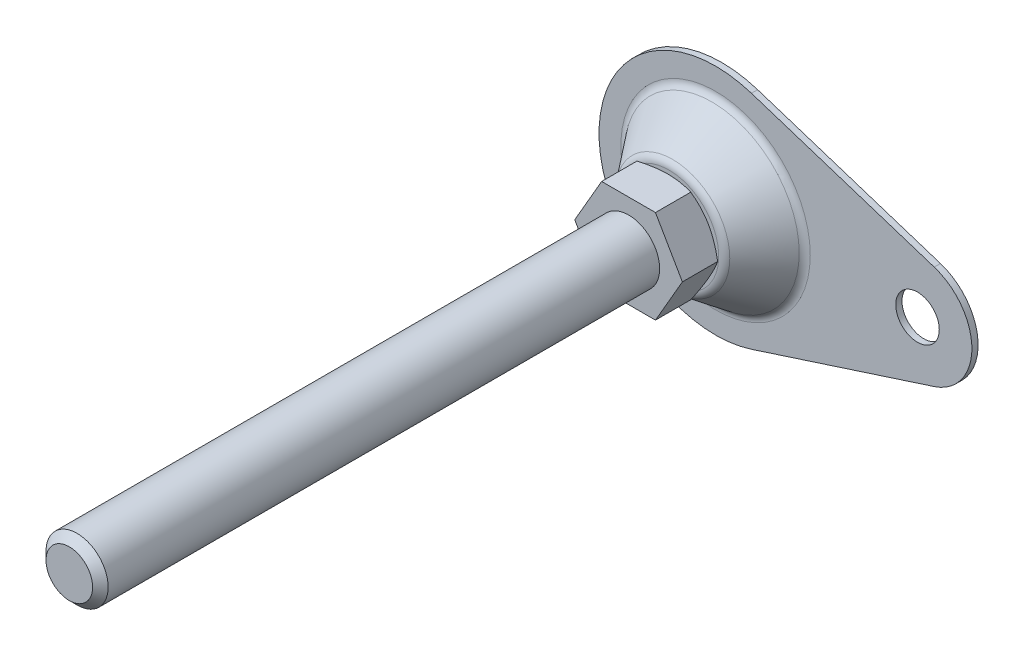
ISO-10303-21;
HEADER;
FILE_DESCRIPTION(('STEP AP214'),'2;1');
FILE_NAME('part.step','',(''),(''),'','','');
FILE_SCHEMA(('AUTOMOTIVE_DESIGN { 1 0 10303 214 1 1 1 1 }'));
ENDSEC;
DATA;
#1=APPLICATION_CONTEXT('core data for automotive mechanical design processes');
#2=APPLICATION_PROTOCOL_DEFINITION('international standard','automotive_design',2000,#1);
#3=PRODUCT_CONTEXT('',#1,'mechanical');
#4=PRODUCT('Part','Part','',(#3));
#5=PRODUCT_RELATED_PRODUCT_CATEGORY('part','',(#4));
#6=PRODUCT_DEFINITION_FORMATION('','',#4);
#7=PRODUCT_DEFINITION_CONTEXT('part definition',#1,'design');
#8=PRODUCT_DEFINITION('design','',#6,#7);
#9=PRODUCT_DEFINITION_SHAPE('','',#8);
#10=(LENGTH_UNIT() NAMED_UNIT(*) SI_UNIT(.MILLI.,.METRE.));
#11=(NAMED_UNIT(*) PLANE_ANGLE_UNIT() SI_UNIT($,.RADIAN.));
#12=(NAMED_UNIT(*) SI_UNIT($,.STERADIAN.) SOLID_ANGLE_UNIT());
#13=UNCERTAINTY_MEASURE_WITH_UNIT(LENGTH_MEASURE(1.E-05),#10,'distance_accuracy_value','');
#14=(GEOMETRIC_REPRESENTATION_CONTEXT(3) GLOBAL_UNCERTAINTY_ASSIGNED_CONTEXT((#13)) GLOBAL_UNIT_ASSIGNED_CONTEXT((#10,
#11,#12)) REPRESENTATION_CONTEXT('',''));
#15=CARTESIAN_POINT('',(0.,0.,0.));
#16=DIRECTION('',(0.,0.,1.));
#17=DIRECTION('',(1.,0.,0.));
#18=AXIS2_PLACEMENT_3D('',#15,#16,#17);
#19=CARTESIAN_POINT('',(65.,0.,2.));
#20=DIRECTION('',(0.,0.,1.));
#21=DIRECTION('',(1.,0.,0.));
#22=AXIS2_PLACEMENT_3D('',#19,#20,#21);
#23=PLANE('',#22);
#24=CARTESIAN_POINT('',(0.,0.,2.));
#25=DIRECTION('',(0.,0.,1.));
#26=DIRECTION('',(1.,0.,0.));
#27=AXIS2_PLACEMENT_3D('',#24,#25,#26);
#28=CIRCLE('',#27,30.4802116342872);
#29=CARTESIAN_POINT('',(30.4802116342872,0.,2.));
#30=VERTEX_POINT('',#29);
#31=EDGE_CURVE('E245',#30,#30,#28,.F.);
#32=ORIENTED_EDGE('',*,*,#31,.T.);
#33=EDGE_LOOP('',(#32));
#34=FACE_BOUND('',#33,.T.);
#35=CARTESIAN_POINT('',(65.,0.,2.));
#36=DIRECTION('',(0.,0.,1.));
#37=DIRECTION('',(1.,0.,0.));
#38=AXIS2_PLACEMENT_3D('',#35,#36,#37);
#39=CIRCLE('',#38,7.);
#40=CARTESIAN_POINT('',(72.,0.,2.));
#41=VERTEX_POINT('',#40);
#42=EDGE_CURVE('E262',#41,#41,#39,.T.);
#43=ORIENTED_EDGE('',*,*,#42,.F.);
#44=EDGE_LOOP('',(#43));
#45=FACE_BOUND('',#44,.T.);
#46=DIRECTION('',(-0.951485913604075,0.307692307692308,0.));
#47=VECTOR('',#46,1.);
#48=CARTESIAN_POINT('',(11.5384615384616,35.6807217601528,2.));
#49=LINE('',#48,#47);
#50=CARTESIAN_POINT('',(70.3846153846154,16.6510034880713,2.));
#51=VERTEX_POINT('',#50);
#52=CARTESIAN_POINT('',(11.5384615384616,35.6807217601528,2.));
#53=VERTEX_POINT('',#52);
#54=EDGE_CURVE('E112',#51,#53,#49,.T.);
#55=ORIENTED_EDGE('',*,*,#54,.T.);
#56=CARTESIAN_POINT('',(0.,0.,2.));
#57=DIRECTION('',(0.,0.,1.));
#58=DIRECTION('',(1.,0.,0.));
#59=AXIS2_PLACEMENT_3D('',#56,#57,#58);
#60=CIRCLE('',#59,37.5);
#61=CARTESIAN_POINT('',(11.5384615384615,-35.6807217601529,2.));
#62=VERTEX_POINT('',#61);
#63=EDGE_CURVE('E114',#53,#62,#60,.T.);
#64=ORIENTED_EDGE('',*,*,#63,.T.);
#65=DIRECTION('',(0.951485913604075,0.307692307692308,0.));
#66=VECTOR('',#65,1.);
#67=CARTESIAN_POINT('',(11.5384615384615,-35.6807217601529,2.));
#68=LINE('',#67,#66);
#69=CARTESIAN_POINT('',(70.3846153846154,-16.6510034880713,2.));
#70=VERTEX_POINT('',#69);
#71=EDGE_CURVE('E97',#62,#70,#68,.T.);
#72=ORIENTED_EDGE('',*,*,#71,.T.);
#73=CARTESIAN_POINT('',(65.,0.,2.));
#74=DIRECTION('',(0.,0.,1.));
#75=DIRECTION('',(1.,0.,0.));
#76=AXIS2_PLACEMENT_3D('',#73,#74,#75);
#77=CIRCLE('',#76,17.5);
#78=EDGE_CURVE('E106',#70,#51,#77,.T.);
#79=ORIENTED_EDGE('',*,*,#78,.T.);
#80=EDGE_LOOP('',(#55,#64,#72,#79));
#81=FACE_BOUND('',#80,.T.);
#82=ADVANCED_FACE('F14',(#34,#45,#81),#23,.T.);
#83=CARTESIAN_POINT('',(65.,0.,0.));
#84=DIRECTION('',(0.,0.,1.));
#85=DIRECTION('',(1.,0.,0.));
#86=AXIS2_PLACEMENT_3D('',#83,#84,#85);
#87=PLANE('',#86);
#88=CARTESIAN_POINT('',(65.,0.,0.));
#89=DIRECTION('',(0.,0.,1.));
#90=DIRECTION('',(1.,0.,0.));
#91=AXIS2_PLACEMENT_3D('',#88,#89,#90);
#92=CIRCLE('',#91,7.);
#93=CARTESIAN_POINT('',(72.,0.,0.));
#94=VERTEX_POINT('',#93);
#95=EDGE_CURVE('E258',#94,#94,#92,.T.);
#96=ORIENTED_EDGE('',*,*,#95,.T.);
#97=EDGE_LOOP('',(#96));
#98=FACE_BOUND('',#97,.T.);
#99=CARTESIAN_POINT('',(0.,0.,0.));
#100=DIRECTION('',(0.,0.,1.));
#101=DIRECTION('',(1.,0.,0.));
#102=AXIS2_PLACEMENT_3D('',#99,#100,#101);
#103=CIRCLE('',#102,37.5);
#104=CARTESIAN_POINT('',(11.5384615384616,35.6807217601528,0.));
#105=VERTEX_POINT('',#104);
#106=CARTESIAN_POINT('',(11.5384615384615,-35.6807217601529,0.));
#107=VERTEX_POINT('',#106);
#108=EDGE_CURVE('E275',#105,#107,#103,.T.);
#109=ORIENTED_EDGE('',*,*,#108,.F.);
#110=DIRECTION('',(-0.951485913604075,0.307692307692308,0.));
#111=VECTOR('',#110,1.);
#112=CARTESIAN_POINT('',(70.3846153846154,16.6510034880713,0.));
#113=LINE('',#112,#111);
#114=CARTESIAN_POINT('',(70.3846153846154,16.6510034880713,0.));
#115=VERTEX_POINT('',#114);
#116=EDGE_CURVE('E9',#115,#105,#113,.T.);
#117=ORIENTED_EDGE('',*,*,#116,.F.);
#118=CARTESIAN_POINT('',(65.,0.,0.));
#119=DIRECTION('',(0.,0.,1.));
#120=DIRECTION('',(1.,0.,0.));
#121=AXIS2_PLACEMENT_3D('',#118,#119,#120);
#122=CIRCLE('',#121,17.5);
#123=CARTESIAN_POINT('',(70.3846153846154,-16.6510034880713,0.));
#124=VERTEX_POINT('',#123);
#125=EDGE_CURVE('E22',#124,#115,#122,.T.);
#126=ORIENTED_EDGE('',*,*,#125,.F.);
#127=DIRECTION('',(0.951485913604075,0.307692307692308,0.));
#128=VECTOR('',#127,1.);
#129=CARTESIAN_POINT('',(70.3846153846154,-16.6510034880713,0.));
#130=LINE('',#129,#128);
#131=EDGE_CURVE('E99',#107,#124,#130,.T.);
#132=ORIENTED_EDGE('',*,*,#131,.F.);
#133=EDGE_LOOP('',(#109,#117,#126,#132));
#134=FACE_BOUND('',#133,.T.);
#135=ADVANCED_FACE('F215',(#98,#134),#87,.F.);
#136=CARTESIAN_POINT('',(0.,0.,17.));
#137=DIRECTION('',(0.,0.,-1.));
#138=DIRECTION('',(-1.,0.,0.));
#139=AXIS2_PLACEMENT_3D('',#136,#137,#138);
#140=PLANE('',#139);
#141=CARTESIAN_POINT('',(0.,0.,17.));
#142=DIRECTION('',(0.,0.,-1.));
#143=DIRECTION('',(-1.,0.,0.));
#144=AXIS2_PLACEMENT_3D('',#141,#142,#143);
#145=CIRCLE('',#144,16.0197883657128);
#146=CARTESIAN_POINT('',(-16.0197883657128,0.,17.));
#147=VERTEX_POINT('',#146);
#148=EDGE_CURVE('E278',#147,#147,#145,.F.);
#149=ORIENTED_EDGE('',*,*,#148,.T.);
#150=EDGE_LOOP('',(#149));
#151=FACE_BOUND('',#150,.T.);
#152=CARTESIAN_POINT('',(0.,0.,17.));
#153=DIRECTION('',(0.,0.,-1.));
#154=DIRECTION('',(-1.,0.,0.));
#155=AXIS2_PLACEMENT_3D('',#152,#153,#154);
#156=CIRCLE('',#155,14.5);
#157=CARTESIAN_POINT('',(-14.5,0.,17.));
#158=VERTEX_POINT('',#157);
#159=EDGE_CURVE('E122',#158,#158,#156,.T.);
#160=ORIENTED_EDGE('',*,*,#159,.T.);
#161=EDGE_LOOP('',(#160));
#162=FACE_BOUND('',#161,.T.);
#163=ADVANCED_FACE('F211',(#151,#162),#140,.F.);
#164=CARTESIAN_POINT('',(0.,0.,5.));
#165=DIRECTION('',(0.,0.,1.));
#166=DIRECTION('',(1.,0.,0.));
#167=AXIS2_PLACEMENT_3D('',#164,#165,#166);
#168=TOROIDAL_SURFACE('',#167,30.4802116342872,3.);
#169=CARTESIAN_POINT('',(0.,0.,3.1747053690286));
#170=DIRECTION('',(0.,0.,1.));
#171=DIRECTION('',(1.,0.,0.));
#172=AXIS2_PLACEMENT_3D('',#169,#170,#171);
#173=CIRCLE('',#172,28.0993925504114);
#174=CARTESIAN_POINT('',(28.0993925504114,0.,3.1747053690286));
#175=VERTEX_POINT('',#174);
#176=EDGE_CURVE('E242',#175,#175,#173,.T.);
#177=ORIENTED_EDGE('',*,*,#176,.F.);
#178=EDGE_LOOP('',(#177));
#179=FACE_BOUND('',#178,.T.);
#180=ORIENTED_EDGE('',*,*,#31,.F.);
#181=EDGE_LOOP('',(#180));
#182=FACE_BOUND('',#181,.T.);
#183=ADVANCED_FACE('F214',(#179,#182),#168,.F.);
#184=CARTESIAN_POINT('',(0.,0.,14.));
#185=DIRECTION('',(0.,0.,-1.));
#186=DIRECTION('',(-1.,0.,0.));
#187=AXIS2_PLACEMENT_3D('',#184,#185,#186);
#188=TOROIDAL_SURFACE('',#187,16.0197883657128,3.);
#189=ORIENTED_EDGE('',*,*,#148,.F.);
#190=EDGE_LOOP('',(#189));
#191=FACE_BOUND('',#190,.T.);
#192=CARTESIAN_POINT('',(0.,0.,15.8252946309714));
#193=DIRECTION('',(0.,0.,1.));
#194=DIRECTION('',(1.,0.,0.));
#195=AXIS2_PLACEMENT_3D('',#192,#193,#194);
#196=CIRCLE('',#195,18.4006074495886);
#197=CARTESIAN_POINT('',(18.4006074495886,0.,15.8252946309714));
#198=VERTEX_POINT('',#197);
#199=EDGE_CURVE('E251',#198,#198,#196,.F.);
#200=ORIENTED_EDGE('',*,*,#199,.F.);
#201=EDGE_LOOP('',(#200));
#202=FACE_BOUND('',#201,.T.);
#203=ADVANCED_FACE('F229',(#191,#202),#188,.T.);
#204=CARTESIAN_POINT('',(0.,0.,2.));
#205=DIRECTION('',(0.,0.,-1.));
#206=DIRECTION('',(-1.,0.,0.));
#207=AXIS2_PLACEMENT_3D('',#204,#205,#206);
#208=CYLINDRICAL_SURFACE('',#207,37.5);
#209=ORIENTED_EDGE('',*,*,#108,.T.);
#210=DIRECTION('',(0.,0.,1.));
#211=VECTOR('',#210,1.);
#212=CARTESIAN_POINT('',(11.5384615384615,-35.6807217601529,-8.));
#213=LINE('',#212,#211);
#214=EDGE_CURVE('E103',#107,#62,#213,.T.);
#215=ORIENTED_EDGE('',*,*,#214,.T.);
#216=ORIENTED_EDGE('',*,*,#63,.F.);
#217=DIRECTION('',(0.,0.,1.));
#218=VECTOR('',#217,1.);
#219=CARTESIAN_POINT('',(11.5384615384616,35.6807217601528,-8.));
#220=LINE('',#219,#218);
#221=EDGE_CURVE('E119',#105,#53,#220,.T.);
#222=ORIENTED_EDGE('',*,*,#221,.F.);
#223=EDGE_LOOP('',(#209,#215,#216,#222));
#224=FACE_BOUND('',#223,.T.);
#225=ADVANCED_FACE('F219',(#224),#208,.T.);
#226=CARTESIAN_POINT('',(65.,0.,2.));
#227=DIRECTION('',(0.,0.,-1.));
#228=DIRECTION('',(-1.,0.,0.));
#229=AXIS2_PLACEMENT_3D('',#226,#227,#228);
#230=CYLINDRICAL_SURFACE('',#229,7.);
#231=ORIENTED_EDGE('',*,*,#42,.T.);
#232=EDGE_LOOP('',(#231));
#233=FACE_BOUND('',#232,.T.);
#234=ORIENTED_EDGE('',*,*,#95,.F.);
#235=EDGE_LOOP('',(#234));
#236=FACE_BOUND('',#235,.T.);
#237=ADVANCED_FACE('F209',(#233,#236),#230,.F.);
#238=CARTESIAN_POINT('',(0.,0.,2.));
#239=DIRECTION('',(0.,0.,-1.));
#240=DIRECTION('',(-1.,0.,0.));
#241=AXIS2_PLACEMENT_3D('',#238,#239,#240);
#242=CONICAL_SURFACE('',#241,29.,0.654082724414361);
#243=ORIENTED_EDGE('',*,*,#176,.T.);
#244=EDGE_LOOP('',(#243));
#245=FACE_BOUND('',#244,.T.);
#246=ORIENTED_EDGE('',*,*,#199,.T.);
#247=EDGE_LOOP('',(#246));
#248=FACE_BOUND('',#247,.T.);
#249=ADVANCED_FACE('F151',(#245,#248),#242,.T.);
#250=CARTESIAN_POINT('',(0.,0.,17.));
#251=DIRECTION('',(0.,0.,1.));
#252=DIRECTION('',(1.,0.,0.));
#253=AXIS2_PLACEMENT_3D('',#250,#251,#252);
#254=CONICAL_SURFACE('',#253,14.5,1.0471975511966);
#255=ORIENTED_EDGE('',*,*,#159,.F.);
#256=EDGE_LOOP('',(#255));
#257=FACE_BOUND('',#256,.T.);
#258=CARTESIAN_POINT('',(17.3206235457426,0.000200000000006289,18.6284877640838));
#259=CARTESIAN_POINT('',(17.130274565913,-0.329494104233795,18.5185969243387));
#260=CARTESIAN_POINT('',(16.939183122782,-0.660474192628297,18.4136927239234));
#261=CARTESIAN_POINT('',(16.5554679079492,-1.32508844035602,18.2152437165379));
#262=CARTESIAN_POINT('',(16.3628436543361,-1.6587234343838,18.1217026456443));
#263=CARTESIAN_POINT('',(15.9756905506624,-2.32929228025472,17.9472372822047));
#264=CARTESIAN_POINT('',(15.7811583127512,-2.66623200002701,17.866342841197));
#265=CARTESIAN_POINT('',(15.3907420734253,-3.34245276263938,17.7189077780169));
#266=CARTESIAN_POINT('',(15.1948581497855,-3.68173367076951,17.6523663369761));
#267=CARTESIAN_POINT('',(14.8067578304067,-4.35394314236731,17.5364675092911));
#268=CARTESIAN_POINT('',(14.6145702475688,-4.68682180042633,17.4867265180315));
#269=CARTESIAN_POINT('',(14.2293144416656,-5.35410443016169,17.4033218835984));
#270=CARTESIAN_POINT('',(14.0362462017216,-5.68850843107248,17.3696585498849));
#271=CARTESIAN_POINT('',(13.6497853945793,-6.35787818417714,17.3192592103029));
#272=CARTESIAN_POINT('',(13.4563934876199,-6.69284279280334,17.3025030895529));
#273=CARTESIAN_POINT('',(13.0694311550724,-7.36308121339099,17.2862785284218));
#274=CARTESIAN_POINT('',(12.8758607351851,-7.69835501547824,17.2868095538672));
#275=CARTESIAN_POINT('',(12.5139822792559,-8.3251468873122,17.303951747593));
#276=CARTESIAN_POINT('',(12.3456484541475,-8.61670962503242,17.3184719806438));
#277=CARTESIAN_POINT('',(12.0093680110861,-9.19916443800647,17.3603122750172));
#278=CARTESIAN_POINT('',(11.8414214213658,-9.49005646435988,17.3876332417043));
#279=CARTESIAN_POINT('',(11.5060066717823,-10.0710118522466,17.4545986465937));
#280=CARTESIAN_POINT('',(11.338539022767,-10.3610743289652,17.4942532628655));
#281=CARTESIAN_POINT('',(11.0043888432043,-10.939839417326,17.5851902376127));
#282=CARTESIAN_POINT('',(10.8377063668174,-11.2285419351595,17.6364733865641));
#283=CARTESIAN_POINT('',(10.3317324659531,-12.1049144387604,17.8090619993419));
#284=CARTESIAN_POINT('',(9.99390625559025,-12.6900465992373,17.9475763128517));
#285=CARTESIAN_POINT('',(9.32329122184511,-13.8515859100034,18.26194710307));
#286=CARTESIAN_POINT('',(8.99049381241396,-14.4280079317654,18.4377297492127));
#287=CARTESIAN_POINT('',(8.66013856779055,-15.0002,18.6284877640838));
#288=B_SPLINE_CURVE_WITH_KNOTS('',3,(#258,#259,#260,#261,#262,#263,#264,#265,#266,#267,#268,
#269,#270,#271,#272,#273,#274,#275,#276,#277,#278,#279,#280,#281,#282,#283,#284,#285,#286,#287),
.UNSPECIFIED.,.F.,.F.,(4,2,2,2,2,2,2,2,2,2,2,2,2,2,4),(0.,1.18875411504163,2.37789802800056,
3.56980778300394,4.76164951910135,5.92407379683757,7.0865204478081,8.24758247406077,
9.40860862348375,10.4193068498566,11.4300765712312,12.4416826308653,13.4533574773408,
15.5211962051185,17.5849760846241),.UNSPECIFIED.);
#289=CARTESIAN_POINT('',(17.3205080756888,0.,18.6284210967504));
#290=VERTEX_POINT('',#289);
#291=CARTESIAN_POINT('',(8.66025403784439,-15.,18.6284210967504));
#292=VERTEX_POINT('',#291);
#293=EDGE_CURVE('E29',#290,#292,#288,.T.);
#294=ORIENTED_EDGE('',*,*,#293,.T.);
#295=CARTESIAN_POINT('',(-23.3958658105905,-15.,24.6738413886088));
#296=CARTESIAN_POINT('',(-23.0677375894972,-15.,24.5143629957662));
#297=CARTESIAN_POINT('',(-22.7392279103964,-15.,24.3556698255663));
#298=CARTESIAN_POINT('',(-22.0813660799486,-15.,24.0400315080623));
#299=CARTESIAN_POINT('',(-21.7520139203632,-15.,23.8830863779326));
#300=CARTESIAN_POINT('',(-20.7624885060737,-15.,23.4150989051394));
#301=CARTESIAN_POINT('',(-20.100941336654,-15.,23.1069507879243));
#302=CARTESIAN_POINT('',(-18.7699276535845,-15.,22.498580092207));
#303=CARTESIAN_POINT('',(-18.1004377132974,-15.,22.1984086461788));
#304=CARTESIAN_POINT('',(-16.7561801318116,-15.,21.6101680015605));
#305=CARTESIAN_POINT('',(-16.0814127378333,-15.,21.3220982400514));
#306=CARTESIAN_POINT('',(-14.7032401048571,-15.,20.7520403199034));
#307=CARTESIAN_POINT('',(-13.9996224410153,-15.,20.4705630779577));
#308=CARTESIAN_POINT('',(-12.5841997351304,-15.,19.9285895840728));
#309=CARTESIAN_POINT('',(-11.8723937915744,-15.,19.6680956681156));
#310=CARTESIAN_POINT('',(-10.4407746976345,-15.,19.174833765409));
#311=CARTESIAN_POINT('',(-9.72098064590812,-15.,18.9420107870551));
#312=CARTESIAN_POINT('',(-8.27100025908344,-15.,18.5114596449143));
#313=CARTESIAN_POINT('',(-7.54081723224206,-15.,18.3137205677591));
#314=CARTESIAN_POINT('',(-6.43963865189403,-15.,18.0510562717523));
#315=CARTESIAN_POINT('',(-6.07262494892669,-15.,17.969339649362));
#316=CARTESIAN_POINT('',(-5.33606522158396,-15.,17.8181817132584));
#317=CARTESIAN_POINT('',(-4.9665192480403,-15.,17.7487401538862));
#318=CARTESIAN_POINT('',(-4.22513940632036,-15.,17.6233496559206));
#319=CARTESIAN_POINT('',(-3.85330557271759,-15.,17.5674005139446));
#320=CARTESIAN_POINT('',(-3.107735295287,-15.,17.4701061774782));
#321=CARTESIAN_POINT('',(-2.73399893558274,-15.,17.4287603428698));
#322=CARTESIAN_POINT('',(-1.99008187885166,-15.,17.3620195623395));
#323=CARTESIAN_POINT('',(-1.61991958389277,-15.,17.3364207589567));
#324=CARTESIAN_POINT('',(-0.878844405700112,-15.,17.3009068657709));
#325=CARTESIAN_POINT('',(-0.507931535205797,-15.,17.2909915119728));
#326=CARTESIAN_POINT('',(0.23398197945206,-15.,17.2870808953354));
#327=CARTESIAN_POINT('',(0.604982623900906,-15.,17.2930856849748));
#328=CARTESIAN_POINT('',(1.34639719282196,-15.,17.3208672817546));
#329=CARTESIAN_POINT('',(1.71681109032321,-15.,17.3426447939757));
#330=CARTESIAN_POINT('',(2.6029970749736,-15.,17.4131480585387));
#331=CARTESIAN_POINT('',(3.11820206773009,-15.,17.4691330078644));
#332=CARTESIAN_POINT('',(4.14487907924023,-15.,17.608599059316));
#333=CARTESIAN_POINT('',(4.6563505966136,-15.,17.6920837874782));
#334=CARTESIAN_POINT('',(5.67504117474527,-15.,17.8835798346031));
#335=CARTESIAN_POINT('',(6.18225669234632,-15.,17.9916098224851));
#336=CARTESIAN_POINT('',(7.19164458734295,-15.,18.228892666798));
#337=CARTESIAN_POINT('',(7.69381703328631,-15.,18.3581452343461));
#338=CARTESIAN_POINT('',(8.70429669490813,-15.,18.6378123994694));
#339=CARTESIAN_POINT('',(9.21249005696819,-15.,18.7886355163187));
#340=CARTESIAN_POINT('',(10.2238722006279,-15.,19.1061343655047));
#341=CARTESIAN_POINT('',(10.7270609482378,-15.,19.2728102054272));
#342=CARTESIAN_POINT('',(11.7286785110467,-15.,19.6193444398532));
#343=CARTESIAN_POINT('',(12.2271087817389,-15.,19.7991986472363));
#344=CARTESIAN_POINT('',(13.2198205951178,-15.,20.169947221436));
#345=CARTESIAN_POINT('',(13.7141021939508,-15.,20.3608414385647));
#346=CARTESIAN_POINT('',(14.9095460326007,-15.,20.8354355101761));
#347=CARTESIAN_POINT('',(15.6088065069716,-15.,21.1239193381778));
#348=CARTESIAN_POINT('',(17.0011291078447,-15.,21.7155204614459));
#349=CARTESIAN_POINT('',(17.6941907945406,-15.,22.0186387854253));
#350=CARTESIAN_POINT('',(19.0753179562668,-15.,22.6364805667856));
#351=CARTESIAN_POINT('',(19.7633821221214,-15.,22.9512069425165));
#352=CARTESIAN_POINT('',(21.1352036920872,-15.,23.5898421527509));
#353=CARTESIAN_POINT('',(21.8189612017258,-15.,23.9137507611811));
#354=CARTESIAN_POINT('',(23.1837251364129,-15.,24.5693719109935));
#355=CARTESIAN_POINT('',(23.8647272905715,-15.,24.901093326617));
#356=CARTESIAN_POINT('',(25.2237460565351,-15.,25.5705960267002));
#357=CARTESIAN_POINT('',(25.9017626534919,-15.,25.9083773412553));
#358=CARTESIAN_POINT('',(27.2551864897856,-15.,26.5888831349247));
#359=CARTESIAN_POINT('',(27.9305940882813,-15.,26.9316069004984));
#360=CARTESIAN_POINT('',(29.2792794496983,-15.,27.6212119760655));
#361=CARTESIAN_POINT('',(29.952557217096,-15.,27.9680932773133));
#362=CARTESIAN_POINT('',(31.8514029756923,-15.,28.9526248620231));
#363=CARTESIAN_POINT('',(33.0748728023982,-15.,29.59432159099));
#364=CARTESIAN_POINT('',(35.5173165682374,-15.,30.8863120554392));
#365=CARTESIAN_POINT('',(36.7362903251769,-15.,31.5366061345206));
#366=CARTESIAN_POINT('',(39.1674593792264,-15.,32.8419904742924));
#367=CARTESIAN_POINT('',(40.3796640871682,-15.,33.4970632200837));
#368=CARTESIAN_POINT('',(42.1958652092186,-15.,34.4834598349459));
#369=CARTESIAN_POINT('',(42.800896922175,-15.,34.812880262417));
#370=CARTESIAN_POINT('',(44.0103398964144,-15.,35.4728560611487));
#371=CARTESIAN_POINT('',(44.6147511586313,-15.,35.803411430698));
#372=CARTESIAN_POINT('',(45.2188879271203,-15.,36.1344678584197));
#373=B_SPLINE_CURVE_WITH_KNOTS('',3,(#295,#296,#297,#298,#299,#300,#301,#302,#303,#304,#305,
#306,#307,#308,#309,#310,#311,#312,#313,#314,#315,#316,#317,#318,#319,#320,#321,#322,#323,#324,
#325,#326,#327,#328,#329,#330,#331,#332,#333,#334,#335,#336,#337,#338,#339,#340,#341,#342,#343,
#344,#345,#346,#347,#348,#349,#350,#351,#352,#353,#354,#355,#356,#357,#358,#359,#360,#361,#362,
#363,#364,#365,#366,#367,#368,#369,#370,#371,#372),.UNSPECIFIED.,.F.,.F.,(4,2,2,2,2,2,2,2,2,2,2,
2,2,2,2,2,2,2,2,2,2,2,2,2,2,2,2,2,2,2,2,2,2,2,2,2,2,2,4),(0.,1.0944903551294,2.18899145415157,
4.37831074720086,6.57932550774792,8.7802377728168,11.0534740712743,13.3269630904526,
15.595855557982,17.8640410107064,18.9918716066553,20.1196796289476,21.2474706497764,
22.3752122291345,23.4880289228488,24.6008268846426,25.7136285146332,26.8264798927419,
28.3803368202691,29.9343987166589,31.4896466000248,33.0448733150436,34.6348707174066,
36.2248789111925,37.8143840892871,39.403867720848,41.6729306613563,43.9421533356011,
46.2119504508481,48.4816917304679,50.7541489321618,53.0266174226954,55.2987610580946,
57.5708999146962,61.7154681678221,65.8602025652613,69.9938338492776,72.0605285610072,
74.1272201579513),.UNSPECIFIED.);
#374=CARTESIAN_POINT('',(-8.6602540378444,-15.,18.6284210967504));
#375=VERTEX_POINT('',#374);
#376=EDGE_CURVE('E158',#292,#375,#373,.F.);
#377=ORIENTED_EDGE('',*,*,#376,.T.);
#378=CARTESIAN_POINT('',(-8.66013856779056,-15.0002,18.6284877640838));
#379=CARTESIAN_POINT('',(-8.85048754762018,-14.6705058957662,18.5185969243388));
#380=CARTESIAN_POINT('',(-9.04157899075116,-14.3395258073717,18.4136927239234));
#381=CARTESIAN_POINT('',(-9.42529420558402,-13.674911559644,18.2152437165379));
#382=CARTESIAN_POINT('',(-9.61791845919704,-13.3412765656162,18.1217026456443));
#383=CARTESIAN_POINT('',(-10.0050715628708,-12.6707077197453,17.9472372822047));
#384=CARTESIAN_POINT('',(-10.199603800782,-12.333767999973,17.866342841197));
#385=CARTESIAN_POINT('',(-10.5900200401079,-11.6575472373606,17.7189077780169));
#386=CARTESIAN_POINT('',(-10.7859039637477,-11.3182663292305,17.6523663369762));
#387=CARTESIAN_POINT('',(-11.1740042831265,-10.6460568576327,17.5364675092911));
#388=CARTESIAN_POINT('',(-11.3661918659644,-10.3131781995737,17.4867265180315));
#389=CARTESIAN_POINT('',(-11.7514476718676,-9.64589556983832,17.4033218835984));
#390=CARTESIAN_POINT('',(-11.9445159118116,-9.31149156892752,17.3696585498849));
#391=CARTESIAN_POINT('',(-12.3309767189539,-8.64212181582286,17.3192592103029));
#392=CARTESIAN_POINT('',(-12.5243686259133,-8.30715720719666,17.3025030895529));
#393=CARTESIAN_POINT('',(-12.9113309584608,-7.63691878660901,17.2862785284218));
#394=CARTESIAN_POINT('',(-13.1049013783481,-7.30164498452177,17.2868095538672));
#395=CARTESIAN_POINT('',(-13.4667798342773,-6.67485311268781,17.303951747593));
#396=CARTESIAN_POINT('',(-13.6351136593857,-6.38329037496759,17.3184719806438));
#397=CARTESIAN_POINT('',(-13.9713941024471,-5.80083556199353,17.3603122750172));
#398=CARTESIAN_POINT('',(-14.1393406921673,-5.50994353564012,17.3876332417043));
#399=CARTESIAN_POINT('',(-14.4747554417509,-4.92898814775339,17.4545986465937));
#400=CARTESIAN_POINT('',(-14.6422230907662,-4.63892567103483,17.4942532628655));
#401=CARTESIAN_POINT('',(-14.9763732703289,-4.06016058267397,17.5851902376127));
#402=CARTESIAN_POINT('',(-15.1430557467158,-3.77145806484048,17.6364733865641));
#403=CARTESIAN_POINT('',(-15.6490296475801,-2.8950855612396,17.8090619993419));
#404=CARTESIAN_POINT('',(-15.9868558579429,-2.30995340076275,17.9475763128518));
#405=CARTESIAN_POINT('',(-16.6574708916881,-1.14841408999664,18.26194710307));
#406=CARTESIAN_POINT('',(-16.9902683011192,-0.571992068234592,18.4377297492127));
#407=CARTESIAN_POINT('',(-17.3206235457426,0.000199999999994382,18.6284877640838));
#408=B_SPLINE_CURVE_WITH_KNOTS('',3,(#378,#379,#380,#381,#382,#383,#384,#385,#386,#387,#388,
#389,#390,#391,#392,#393,#394,#395,#396,#397,#398,#399,#400,#401,#402,#403,#404,#405,#406,#407),
.UNSPECIFIED.,.F.,.F.,(4,2,2,2,2,2,2,2,2,2,2,2,2,2,4),(0.,1.18875411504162,2.37789802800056,
3.56980778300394,4.76164951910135,5.92407379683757,7.0865204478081,8.24758247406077,
9.40860862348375,10.4193068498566,11.4300765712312,12.4416826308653,13.4533574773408,
15.5211962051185,17.5849760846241),.UNSPECIFIED.);
#409=CARTESIAN_POINT('',(-17.3205080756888,0.,18.6284210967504));
#410=VERTEX_POINT('',#409);
#411=EDGE_CURVE('E127',#375,#410,#408,.T.);
#412=ORIENTED_EDGE('',*,*,#411,.T.);
#413=CARTESIAN_POINT('',(-17.3206235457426,-0.000200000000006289,18.6284877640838));
#414=CARTESIAN_POINT('',(-17.130274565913,0.329494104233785,18.5185969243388));
#415=CARTESIAN_POINT('',(-16.939183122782,0.660474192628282,18.4136927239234));
#416=CARTESIAN_POINT('',(-16.5554679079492,1.325088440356,18.2152437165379));
#417=CARTESIAN_POINT('',(-16.3628436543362,1.65872343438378,18.1217026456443));
#418=CARTESIAN_POINT('',(-15.9756905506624,2.32929228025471,17.9472372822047));
#419=CARTESIAN_POINT('',(-15.7811583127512,2.666232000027,17.866342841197));
#420=CARTESIAN_POINT('',(-15.3907420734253,3.34245276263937,17.7189077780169));
#421=CARTESIAN_POINT('',(-15.1948581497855,3.6817336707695,17.6523663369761));
#422=CARTESIAN_POINT('',(-14.8067578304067,4.3539431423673,17.5364675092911));
#423=CARTESIAN_POINT('',(-14.6145702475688,4.68682180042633,17.4867265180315));
#424=CARTESIAN_POINT('',(-14.2293144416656,5.35410443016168,17.4033218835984));
#425=CARTESIAN_POINT('',(-14.0362462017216,5.68850843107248,17.3696585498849));
#426=CARTESIAN_POINT('',(-13.6497853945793,6.35787818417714,17.3192592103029));
#427=CARTESIAN_POINT('',(-13.4563934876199,6.69284279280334,17.3025030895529));
#428=CARTESIAN_POINT('',(-13.0694311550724,7.363081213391,17.2862785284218));
#429=CARTESIAN_POINT('',(-12.8758607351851,7.69835501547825,17.2868095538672));
#430=CARTESIAN_POINT('',(-12.5139822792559,8.32514688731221,17.303951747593));
#431=CARTESIAN_POINT('',(-12.3456484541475,8.61670962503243,17.3184719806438));
#432=CARTESIAN_POINT('',(-12.0093680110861,9.19916443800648,17.3603122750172));
#433=CARTESIAN_POINT('',(-11.8414214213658,9.49005646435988,17.3876332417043));
#434=CARTESIAN_POINT('',(-11.5060066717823,10.0710118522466,17.4545986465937));
#435=CARTESIAN_POINT('',(-11.338539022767,10.3610743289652,17.4942532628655));
#436=CARTESIAN_POINT('',(-11.0043888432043,10.939839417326,17.5851902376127));
#437=CARTESIAN_POINT('',(-10.8377063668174,11.2285419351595,17.6364733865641));
#438=CARTESIAN_POINT('',(-10.3317324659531,12.1049144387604,17.8090619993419));
#439=CARTESIAN_POINT('',(-9.99390625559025,12.6900465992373,17.9475763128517));
#440=CARTESIAN_POINT('',(-9.32329122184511,13.8515859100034,18.26194710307));
#441=CARTESIAN_POINT('',(-8.99049381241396,14.4280079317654,18.4377297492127));
#442=CARTESIAN_POINT('',(-8.66013856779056,15.0002,18.6284877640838));
#443=B_SPLINE_CURVE_WITH_KNOTS('',3,(#413,#414,#415,#416,#417,#418,#419,#420,#421,#422,#423,
#424,#425,#426,#427,#428,#429,#430,#431,#432,#433,#434,#435,#436,#437,#438,#439,#440,#441,#442),
.UNSPECIFIED.,.F.,.F.,(4,2,2,2,2,2,2,2,2,2,2,2,2,2,4),(0.,1.18875411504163,2.37789802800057,
3.56980778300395,4.76164951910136,5.92407379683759,7.08652044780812,8.24758247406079,
9.40860862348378,10.4193068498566,11.4300765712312,12.4416826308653,13.4533574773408,
15.5211962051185,17.5849760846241),.UNSPECIFIED.);
#444=CARTESIAN_POINT('',(-8.66025403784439,15.,18.6284210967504));
#445=VERTEX_POINT('',#444);
#446=EDGE_CURVE('E135',#410,#445,#443,.T.);
#447=ORIENTED_EDGE('',*,*,#446,.T.);
#448=CARTESIAN_POINT('',(-23.3958658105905,15.,24.6738413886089));
#449=CARTESIAN_POINT('',(-23.0677375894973,15.,24.5143629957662));
#450=CARTESIAN_POINT('',(-22.7392279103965,15.,24.3556698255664));
#451=CARTESIAN_POINT('',(-22.0813660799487,15.,24.0400315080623));
#452=CARTESIAN_POINT('',(-21.7520139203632,15.,23.8830863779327));
#453=CARTESIAN_POINT('',(-20.7624885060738,15.,23.4150989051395));
#454=CARTESIAN_POINT('',(-20.1009413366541,15.,23.1069507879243));
#455=CARTESIAN_POINT('',(-18.7699276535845,15.,22.498580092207));
#456=CARTESIAN_POINT('',(-18.1004377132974,15.,22.1984086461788));
#457=CARTESIAN_POINT('',(-16.7561801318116,15.,21.6101680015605));
#458=CARTESIAN_POINT('',(-16.0814127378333,15.,21.3220982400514));
#459=CARTESIAN_POINT('',(-14.7032401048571,15.,20.7520403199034));
#460=CARTESIAN_POINT('',(-13.9996224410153,15.,20.4705630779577));
#461=CARTESIAN_POINT('',(-12.5841997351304,15.,19.9285895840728));
#462=CARTESIAN_POINT('',(-11.8723937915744,15.,19.6680956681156));
#463=CARTESIAN_POINT('',(-10.4407746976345,15.,19.174833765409));
#464=CARTESIAN_POINT('',(-9.72098064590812,15.,18.9420107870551));
#465=CARTESIAN_POINT('',(-8.27100025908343,15.,18.5114596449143));
#466=CARTESIAN_POINT('',(-7.54081723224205,15.,18.3137205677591));
#467=CARTESIAN_POINT('',(-6.43963865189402,15.,18.0510562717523));
#468=CARTESIAN_POINT('',(-6.07262494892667,15.,17.969339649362));
#469=CARTESIAN_POINT('',(-5.33606522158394,15.,17.8181817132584));
#470=CARTESIAN_POINT('',(-4.96651924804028,15.,17.7487401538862));
#471=CARTESIAN_POINT('',(-4.22513940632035,15.,17.6233496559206));
#472=CARTESIAN_POINT('',(-3.85330557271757,15.,17.5674005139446));
#473=CARTESIAN_POINT('',(-3.10773529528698,15.,17.4701061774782));
#474=CARTESIAN_POINT('',(-2.73399893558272,15.,17.4287603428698));
#475=CARTESIAN_POINT('',(-1.99008187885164,15.,17.3620195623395));
#476=CARTESIAN_POINT('',(-1.61991958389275,15.,17.3364207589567));
#477=CARTESIAN_POINT('',(-0.878844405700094,15.,17.3009068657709));
#478=CARTESIAN_POINT('',(-0.50793153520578,15.,17.2909915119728));
#479=CARTESIAN_POINT('',(0.233981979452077,15.,17.2870808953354));
#480=CARTESIAN_POINT('',(0.604982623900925,15.,17.2930856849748));
#481=CARTESIAN_POINT('',(1.34639719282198,15.,17.3208672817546));
#482=CARTESIAN_POINT('',(1.71681109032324,15.,17.3426447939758));
#483=CARTESIAN_POINT('',(2.60299707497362,15.,17.4131480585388));
#484=CARTESIAN_POINT('',(3.11820206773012,15.,17.4691330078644));
#485=CARTESIAN_POINT('',(4.14487907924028,15.,17.608599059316));
#486=CARTESIAN_POINT('',(4.65635059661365,15.,17.6920837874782));
#487=CARTESIAN_POINT('',(5.67504117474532,15.,17.8835798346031));
#488=CARTESIAN_POINT('',(6.18225669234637,15.,17.9916098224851));
#489=CARTESIAN_POINT('',(7.19164458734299,15.,18.228892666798));
#490=CARTESIAN_POINT('',(7.69381703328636,15.,18.3581452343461));
#491=CARTESIAN_POINT('',(8.70429669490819,15.,18.6378123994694));
#492=CARTESIAN_POINT('',(9.21249005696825,15.,18.7886355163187));
#493=CARTESIAN_POINT('',(10.223872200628,15.,19.1061343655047));
#494=CARTESIAN_POINT('',(10.7270609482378,15.,19.2728102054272));
#495=CARTESIAN_POINT('',(11.7286785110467,15.,19.6193444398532));
#496=CARTESIAN_POINT('',(12.227108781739,15.,19.7991986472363));
#497=CARTESIAN_POINT('',(13.2198205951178,15.,20.169947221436));
#498=CARTESIAN_POINT('',(13.7141021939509,15.,20.3608414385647));
#499=CARTESIAN_POINT('',(14.9095460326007,15.,20.8354355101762));
#500=CARTESIAN_POINT('',(15.6088065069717,15.,21.1239193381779));
#501=CARTESIAN_POINT('',(17.0011291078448,15.,21.715520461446));
#502=CARTESIAN_POINT('',(17.6941907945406,15.,22.0186387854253));
#503=CARTESIAN_POINT('',(19.0753179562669,15.,22.6364805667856));
#504=CARTESIAN_POINT('',(19.7633821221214,15.,22.9512069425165));
#505=CARTESIAN_POINT('',(21.1352036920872,15.,23.589842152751));
#506=CARTESIAN_POINT('',(21.8189612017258,15.,23.9137507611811));
#507=CARTESIAN_POINT('',(23.1837251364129,15.,24.5693719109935));
#508=CARTESIAN_POINT('',(23.8647272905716,15.,24.901093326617));
#509=CARTESIAN_POINT('',(25.2237460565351,15.,25.5705960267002));
#510=CARTESIAN_POINT('',(25.9017626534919,15.,25.9083773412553));
#511=CARTESIAN_POINT('',(27.2551864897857,15.,26.5888831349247));
#512=CARTESIAN_POINT('',(27.9305940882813,15.,26.9316069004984));
#513=CARTESIAN_POINT('',(29.2792794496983,15.,27.6212119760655));
#514=CARTESIAN_POINT('',(29.952557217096,15.,27.9680932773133));
#515=CARTESIAN_POINT('',(31.8514029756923,15.,28.9526248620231));
#516=CARTESIAN_POINT('',(33.0748728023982,15.,29.59432159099));
#517=CARTESIAN_POINT('',(35.5173165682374,15.,30.8863120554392));
#518=CARTESIAN_POINT('',(36.7362903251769,15.,31.5366061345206));
#519=CARTESIAN_POINT('',(39.1674593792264,15.,32.8419904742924));
#520=CARTESIAN_POINT('',(40.3796640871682,15.,33.4970632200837));
#521=CARTESIAN_POINT('',(42.1958652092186,15.,34.4834598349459));
#522=CARTESIAN_POINT('',(42.800896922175,15.,34.812880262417));
#523=CARTESIAN_POINT('',(44.0103398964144,15.,35.4728560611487));
#524=CARTESIAN_POINT('',(44.6147511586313,15.,35.803411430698));
#525=CARTESIAN_POINT('',(45.2188879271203,15.,36.1344678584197));
#526=B_SPLINE_CURVE_WITH_KNOTS('',3,(#448,#449,#450,#451,#452,#453,#454,#455,#456,#457,#458,
#459,#460,#461,#462,#463,#464,#465,#466,#467,#468,#469,#470,#471,#472,#473,#474,#475,#476,#477,
#478,#479,#480,#481,#482,#483,#484,#485,#486,#487,#488,#489,#490,#491,#492,#493,#494,#495,#496,
#497,#498,#499,#500,#501,#502,#503,#504,#505,#506,#507,#508,#509,#510,#511,#512,#513,#514,#515,
#516,#517,#518,#519,#520,#521,#522,#523,#524,#525),.UNSPECIFIED.,.F.,.F.,(4,2,2,2,2,2,2,2,2,2,2,
2,2,2,2,2,2,2,2,2,2,2,2,2,2,2,2,2,2,2,2,2,2,2,2,2,2,2,4),(0.,1.0944903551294,2.18899145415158,
4.37831074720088,6.57932550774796,8.78023777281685,11.0534740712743,13.3269630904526,
15.5958555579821,17.8640410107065,18.9918716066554,20.1196796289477,21.2474706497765,
22.3752122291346,23.4880289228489,24.6008268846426,25.7136285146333,26.826479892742,
28.3803368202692,29.934398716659,31.4896466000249,33.0448733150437,34.6348707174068,
36.2248789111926,37.8143840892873,39.4038677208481,41.6729306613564,43.9421533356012,
46.2119504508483,48.481691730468,50.7541489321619,53.0266174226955,55.2987610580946,
57.5708999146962,61.7154681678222,65.8602025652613,69.9938338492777,72.0605285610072,
74.1272201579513),.UNSPECIFIED.);
#527=CARTESIAN_POINT('',(8.66025403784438,15.,18.6284210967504));
#528=VERTEX_POINT('',#527);
#529=EDGE_CURVE('E169',#445,#528,#526,.T.);
#530=ORIENTED_EDGE('',*,*,#529,.T.);
#531=CARTESIAN_POINT('',(8.66013856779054,15.0002,18.6284877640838));
#532=CARTESIAN_POINT('',(8.85048754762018,14.6705058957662,18.5185969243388));
#533=CARTESIAN_POINT('',(9.04157899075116,14.3395258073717,18.4136927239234));
#534=CARTESIAN_POINT('',(9.42529420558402,13.674911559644,18.2152437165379));
#535=CARTESIAN_POINT('',(9.61791845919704,13.3412765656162,18.1217026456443));
#536=CARTESIAN_POINT('',(10.0050715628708,12.6707077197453,17.9472372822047));
#537=CARTESIAN_POINT('',(10.199603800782,12.333767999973,17.866342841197));
#538=CARTESIAN_POINT('',(10.5900200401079,11.6575472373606,17.7189077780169));
#539=CARTESIAN_POINT('',(10.7859039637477,11.3182663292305,17.6523663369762));
#540=CARTESIAN_POINT('',(11.1740042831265,10.6460568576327,17.5364675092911));
#541=CARTESIAN_POINT('',(11.3661918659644,10.3131781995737,17.4867265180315));
#542=CARTESIAN_POINT('',(11.7514476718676,9.64589556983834,17.4033218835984));
#543=CARTESIAN_POINT('',(11.9445159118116,9.31149156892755,17.3696585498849));
#544=CARTESIAN_POINT('',(12.3309767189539,8.64212181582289,17.3192592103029));
#545=CARTESIAN_POINT('',(12.5243686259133,8.3071572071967,17.3025030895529));
#546=CARTESIAN_POINT('',(12.9113309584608,7.63691878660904,17.2862785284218));
#547=CARTESIAN_POINT('',(13.104901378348,7.30164498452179,17.2868095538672));
#548=CARTESIAN_POINT('',(13.4667798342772,6.67485311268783,17.303951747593));
#549=CARTESIAN_POINT('',(13.6351136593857,6.38329037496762,17.3184719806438));
#550=CARTESIAN_POINT('',(13.9713941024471,5.80083556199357,17.3603122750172));
#551=CARTESIAN_POINT('',(14.1393406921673,5.50994353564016,17.3876332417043));
#552=CARTESIAN_POINT('',(14.4747554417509,4.92898814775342,17.4545986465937));
#553=CARTESIAN_POINT('',(14.6422230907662,4.63892567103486,17.4942532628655));
#554=CARTESIAN_POINT('',(14.9763732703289,4.06016058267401,17.5851902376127));
#555=CARTESIAN_POINT('',(15.1430557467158,3.77145806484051,17.6364733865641));
#556=CARTESIAN_POINT('',(15.6490296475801,2.89508556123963,17.8090619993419));
#557=CARTESIAN_POINT('',(15.9868558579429,2.30995340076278,17.9475763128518));
#558=CARTESIAN_POINT('',(16.6574708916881,1.14841408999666,18.26194710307));
#559=CARTESIAN_POINT('',(16.9902683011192,0.571992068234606,18.4377297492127));
#560=CARTESIAN_POINT('',(17.3206235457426,-0.000199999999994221,18.6284877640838));
#561=B_SPLINE_CURVE_WITH_KNOTS('',3,(#531,#532,#533,#534,#535,#536,#537,#538,#539,#540,#541,
#542,#543,#544,#545,#546,#547,#548,#549,#550,#551,#552,#553,#554,#555,#556,#557,#558,#559,#560),
.UNSPECIFIED.,.F.,.F.,(4,2,2,2,2,2,2,2,2,2,2,2,2,2,4),(0.,1.18875411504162,2.37789802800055,
3.56980778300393,4.76164951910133,5.92407379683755,7.08652044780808,8.24758247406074,
9.40860862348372,10.4193068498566,11.4300765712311,12.4416826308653,13.4533574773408,
15.5211962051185,17.5849760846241),.UNSPECIFIED.);
#562=EDGE_CURVE('E176',#528,#290,#561,.T.);
#563=ORIENTED_EDGE('',*,*,#562,.T.);
#564=EDGE_LOOP('',(#294,#377,#412,#447,#530,#563));
#565=FACE_BOUND('',#564,.T.);
#566=ADVANCED_FACE('F145',(#257,#565),#254,.T.);
#567=CARTESIAN_POINT('',(0.,0.,210.));
#568=DIRECTION('',(0.,0.,1.));
#569=DIRECTION('',(1.,0.,0.));
#570=AXIS2_PLACEMENT_3D('',#567,#568,#569);
#571=PLANE('',#570);
#572=CARTESIAN_POINT('',(0.,0.,210.));
#573=DIRECTION('',(0.,0.,1.));
#574=DIRECTION('',(1.,0.,0.));
#575=AXIS2_PLACEMENT_3D('',#572,#573,#574);
#576=CIRCLE('',#575,7.50000000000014);
#577=CARTESIAN_POINT('',(7.50000000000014,0.,210.));
#578=VERTEX_POINT('',#577);
#579=EDGE_CURVE('E246',#578,#578,#576,.T.);
#580=ORIENTED_EDGE('',*,*,#579,.T.);
#581=EDGE_LOOP('',(#580));
#582=FACE_BOUND('',#581,.T.);
#583=ADVANCED_FACE('F150',(#582),#571,.T.);
#584=CARTESIAN_POINT('',(0.,0.,210.));
#585=DIRECTION('',(0.,0.,-1.));
#586=DIRECTION('',(-1.,0.,0.));
#587=AXIS2_PLACEMENT_3D('',#584,#585,#586);
#588=CONICAL_SURFACE('',#587,7.50000000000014,0.785398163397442);
#589=CARTESIAN_POINT('',(0.,0.,207.5));
#590=DIRECTION('',(0.,0.,1.));
#591=DIRECTION('',(1.,0.,0.));
#592=AXIS2_PLACEMENT_3D('',#589,#590,#591);
#593=CIRCLE('',#592,10.);
#594=CARTESIAN_POINT('',(10.,0.,207.5));
#595=VERTEX_POINT('',#594);
#596=EDGE_CURVE('E249',#595,#595,#593,.F.);
#597=ORIENTED_EDGE('',*,*,#596,.F.);
#598=EDGE_LOOP('',(#597));
#599=FACE_BOUND('',#598,.T.);
#600=ORIENTED_EDGE('',*,*,#579,.F.);
#601=EDGE_LOOP('',(#600));
#602=FACE_BOUND('',#601,.T.);
#603=ADVANCED_FACE('F16',(#599,#602),#588,.T.);
#604=CARTESIAN_POINT('',(0.,0.,210.));
#605=DIRECTION('',(0.,0.,-1.));
#606=DIRECTION('',(-1.,0.,0.));
#607=AXIS2_PLACEMENT_3D('',#604,#605,#606);
#608=CYLINDRICAL_SURFACE('',#607,10.);
#609=CARTESIAN_POINT('',(0.,0.,30.));
#610=DIRECTION('',(0.,0.,1.));
#611=DIRECTION('',(1.,0.,0.));
#612=AXIS2_PLACEMENT_3D('',#609,#610,#611);
#613=CIRCLE('',#612,10.);
#614=CARTESIAN_POINT('',(10.,0.,30.));
#615=VERTEX_POINT('',#614);
#616=EDGE_CURVE('E256',#615,#615,#613,.T.);
#617=ORIENTED_EDGE('',*,*,#616,.T.);
#618=EDGE_LOOP('',(#617));
#619=FACE_BOUND('',#618,.T.);
#620=ORIENTED_EDGE('',*,*,#596,.T.);
#621=EDGE_LOOP('',(#620));
#622=FACE_BOUND('',#621,.T.);
#623=ADVANCED_FACE('F203',(#619,#622),#608,.T.);
#624=CARTESIAN_POINT('',(0.,0.,30.));
#625=DIRECTION('',(0.,0.,1.));
#626=DIRECTION('',(1.,0.,0.));
#627=AXIS2_PLACEMENT_3D('',#624,#625,#626);
#628=PLANE('',#627);
#629=DIRECTION('',(0.5,0.866025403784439,0.));
#630=VECTOR('',#629,1.);
#631=CARTESIAN_POINT('',(8.66025403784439,-15.,30.));
#632=LINE('',#631,#630);
#633=CARTESIAN_POINT('',(8.66025403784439,-15.,30.));
#634=VERTEX_POINT('',#633);
#635=CARTESIAN_POINT('',(17.3205080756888,0.,30.));
#636=VERTEX_POINT('',#635);
#637=EDGE_CURVE('E321',#634,#636,#632,.T.);
#638=ORIENTED_EDGE('',*,*,#637,.T.);
#639=DIRECTION('',(-0.5,0.866025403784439,0.));
#640=VECTOR('',#639,1.);
#641=CARTESIAN_POINT('',(17.3205080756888,0.,30.));
#642=LINE('',#641,#640);
#643=CARTESIAN_POINT('',(8.66025403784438,15.,30.));
#644=VERTEX_POINT('',#643);
#645=EDGE_CURVE('E320',#636,#644,#642,.T.);
#646=ORIENTED_EDGE('',*,*,#645,.T.);
#647=DIRECTION('',(-1.,0.,0.));
#648=VECTOR('',#647,1.);
#649=CARTESIAN_POINT('',(8.66025403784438,15.,30.));
#650=LINE('',#649,#648);
#651=CARTESIAN_POINT('',(-8.66025403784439,15.,30.));
#652=VERTEX_POINT('',#651);
#653=EDGE_CURVE('E318',#644,#652,#650,.T.);
#654=ORIENTED_EDGE('',*,*,#653,.T.);
#655=DIRECTION('',(-0.5,-0.866025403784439,0.));
#656=VECTOR('',#655,1.);
#657=CARTESIAN_POINT('',(-8.66025403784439,15.,30.));
#658=LINE('',#657,#656);
#659=CARTESIAN_POINT('',(-17.3205080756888,0.,30.));
#660=VERTEX_POINT('',#659);
#661=EDGE_CURVE('E314',#652,#660,#658,.T.);
#662=ORIENTED_EDGE('',*,*,#661,.T.);
#663=DIRECTION('',(0.5,-0.866025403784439,0.));
#664=VECTOR('',#663,1.);
#665=CARTESIAN_POINT('',(-17.3205080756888,0.,30.));
#666=LINE('',#665,#664);
#667=CARTESIAN_POINT('',(-8.6602540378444,-15.,30.));
#668=VERTEX_POINT('',#667);
#669=EDGE_CURVE('E328',#660,#668,#666,.T.);
#670=ORIENTED_EDGE('',*,*,#669,.T.);
#671=DIRECTION('',(1.,0.,0.));
#672=VECTOR('',#671,1.);
#673=CARTESIAN_POINT('',(-8.6602540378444,-15.,30.));
#674=LINE('',#673,#672);
#675=EDGE_CURVE('E37',#668,#634,#674,.T.);
#676=ORIENTED_EDGE('',*,*,#675,.T.);
#677=EDGE_LOOP('',(#638,#646,#654,#662,#670,#676));
#678=FACE_BOUND('',#677,.T.);
#679=ORIENTED_EDGE('',*,*,#616,.F.);
#680=EDGE_LOOP('',(#679));
#681=FACE_BOUND('',#680,.T.);
#682=ADVANCED_FACE('F154',(#678,#681),#628,.T.);
#683=CARTESIAN_POINT('',(-8.6602540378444,-15.,30.));
#684=DIRECTION('',(0.,1.,0.));
#685=DIRECTION('',(0.,0.,1.));
#686=AXIS2_PLACEMENT_3D('',#683,#684,#685);
#687=PLANE('',#686);
#688=ORIENTED_EDGE('',*,*,#376,.F.);
#689=DIRECTION('',(0.,0.,-1.));
#690=VECTOR('',#689,1.);
#691=CARTESIAN_POINT('',(8.66025403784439,-15.,30.));
#692=LINE('',#691,#690);
#693=EDGE_CURVE('E304',#634,#292,#692,.T.);
#694=ORIENTED_EDGE('',*,*,#693,.F.);
#695=ORIENTED_EDGE('',*,*,#675,.F.);
#696=DIRECTION('',(0.,0.,-1.));
#697=VECTOR('',#696,1.);
#698=CARTESIAN_POINT('',(-8.6602540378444,-15.,30.));
#699=LINE('',#698,#697);
#700=EDGE_CURVE('E300',#668,#375,#699,.T.);
#701=ORIENTED_EDGE('',*,*,#700,.T.);
#702=EDGE_LOOP('',(#688,#694,#695,#701));
#703=FACE_BOUND('',#702,.T.);
#704=ADVANCED_FACE('F303',(#703),#687,.F.);
#705=CARTESIAN_POINT('',(-17.3205080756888,0.,30.));
#706=DIRECTION('',(0.866025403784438,0.5,0.));
#707=DIRECTION('',(-0.5,0.866025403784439,0.));
#708=AXIS2_PLACEMENT_3D('',#705,#706,#707);
#709=PLANE('',#708);
#710=ORIENTED_EDGE('',*,*,#411,.F.);
#711=ORIENTED_EDGE('',*,*,#700,.F.);
#712=ORIENTED_EDGE('',*,*,#669,.F.);
#713=DIRECTION('',(0.,0.,-1.));
#714=VECTOR('',#713,1.);
#715=CARTESIAN_POINT('',(-17.3205080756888,0.,30.));
#716=LINE('',#715,#714);
#717=EDGE_CURVE('E302',#660,#410,#716,.T.);
#718=ORIENTED_EDGE('',*,*,#717,.T.);
#719=EDGE_LOOP('',(#710,#711,#712,#718));
#720=FACE_BOUND('',#719,.T.);
#721=ADVANCED_FACE('F142',(#720),#709,.F.);
#722=CARTESIAN_POINT('',(-8.66025403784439,15.,30.));
#723=DIRECTION('',(0.866025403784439,-0.5,0.));
#724=DIRECTION('',(0.5,0.866025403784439,0.));
#725=AXIS2_PLACEMENT_3D('',#722,#723,#724);
#726=PLANE('',#725);
#727=ORIENTED_EDGE('',*,*,#446,.F.);
#728=ORIENTED_EDGE('',*,*,#717,.F.);
#729=ORIENTED_EDGE('',*,*,#661,.F.);
#730=DIRECTION('',(0.,0.,-1.));
#731=VECTOR('',#730,1.);
#732=CARTESIAN_POINT('',(-8.66025403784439,15.,30.));
#733=LINE('',#732,#731);
#734=EDGE_CURVE('E270',#652,#445,#733,.T.);
#735=ORIENTED_EDGE('',*,*,#734,.T.);
#736=EDGE_LOOP('',(#727,#728,#729,#735));
#737=FACE_BOUND('',#736,.T.);
#738=ADVANCED_FACE('F313',(#737),#726,.F.);
#739=CARTESIAN_POINT('',(8.66025403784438,15.,30.));
#740=DIRECTION('',(0.,-1.,0.));
#741=DIRECTION('',(0.,0.,-1.));
#742=AXIS2_PLACEMENT_3D('',#739,#740,#741);
#743=PLANE('',#742);
#744=ORIENTED_EDGE('',*,*,#529,.F.);
#745=ORIENTED_EDGE('',*,*,#734,.F.);
#746=ORIENTED_EDGE('',*,*,#653,.F.);
#747=DIRECTION('',(0.,0.,-1.));
#748=VECTOR('',#747,1.);
#749=CARTESIAN_POINT('',(8.66025403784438,15.,30.));
#750=LINE('',#749,#748);
#751=EDGE_CURVE('E265',#644,#528,#750,.T.);
#752=ORIENTED_EDGE('',*,*,#751,.T.);
#753=EDGE_LOOP('',(#744,#745,#746,#752));
#754=FACE_BOUND('',#753,.T.);
#755=ADVANCED_FACE('F192',(#754),#743,.F.);
#756=CARTESIAN_POINT('',(17.3205080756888,0.,30.));
#757=DIRECTION('',(-0.866025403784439,-0.5,0.));
#758=DIRECTION('',(0.5,-0.866025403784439,0.));
#759=AXIS2_PLACEMENT_3D('',#756,#757,#758);
#760=PLANE('',#759);
#761=ORIENTED_EDGE('',*,*,#562,.F.);
#762=ORIENTED_EDGE('',*,*,#751,.F.);
#763=ORIENTED_EDGE('',*,*,#645,.F.);
#764=DIRECTION('',(0.,0.,-1.));
#765=VECTOR('',#764,1.);
#766=CARTESIAN_POINT('',(17.3205080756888,0.,30.));
#767=LINE('',#766,#765);
#768=EDGE_CURVE('E259',#636,#290,#767,.T.);
#769=ORIENTED_EDGE('',*,*,#768,.T.);
#770=EDGE_LOOP('',(#761,#762,#763,#769));
#771=FACE_BOUND('',#770,.T.);
#772=ADVANCED_FACE('F188',(#771),#760,.F.);
#773=CARTESIAN_POINT('',(8.66025403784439,-15.,30.));
#774=DIRECTION('',(-0.866025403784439,0.5,0.));
#775=DIRECTION('',(-0.5,-0.866025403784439,0.));
#776=AXIS2_PLACEMENT_3D('',#773,#774,#775);
#777=PLANE('',#776);
#778=ORIENTED_EDGE('',*,*,#293,.F.);
#779=ORIENTED_EDGE('',*,*,#768,.F.);
#780=ORIENTED_EDGE('',*,*,#637,.F.);
#781=ORIENTED_EDGE('',*,*,#693,.T.);
#782=EDGE_LOOP('',(#778,#779,#780,#781));
#783=FACE_BOUND('',#782,.T.);
#784=ADVANCED_FACE('F191',(#783),#777,.F.);
#785=CARTESIAN_POINT('',(11.5384615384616,35.6807217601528,-8.));
#786=DIRECTION('',(0.307692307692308,0.951485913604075,0.));
#787=DIRECTION('',(-0.951485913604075,0.307692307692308,0.));
#788=AXIS2_PLACEMENT_3D('',#785,#786,#787);
#789=PLANE('',#788);
#790=ORIENTED_EDGE('',*,*,#116,.T.);
#791=ORIENTED_EDGE('',*,*,#221,.T.);
#792=ORIENTED_EDGE('',*,*,#54,.F.);
#793=DIRECTION('',(0.,0.,1.));
#794=VECTOR('',#793,1.);
#795=CARTESIAN_POINT('',(70.3846153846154,16.6510034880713,-8.));
#796=LINE('',#795,#794);
#797=EDGE_CURVE('E102',#115,#51,#796,.T.);
#798=ORIENTED_EDGE('',*,*,#797,.F.);
#799=EDGE_LOOP('',(#790,#791,#792,#798));
#800=FACE_BOUND('',#799,.T.);
#801=ADVANCED_FACE('F198',(#800),#789,.T.);
#802=CARTESIAN_POINT('',(65.,0.,-8.));
#803=DIRECTION('',(0.,0.,1.));
#804=DIRECTION('',(1.,0.,0.));
#805=AXIS2_PLACEMENT_3D('',#802,#803,#804);
#806=CYLINDRICAL_SURFACE('',#805,17.5);
#807=ORIENTED_EDGE('',*,*,#125,.T.);
#808=ORIENTED_EDGE('',*,*,#797,.T.);
#809=ORIENTED_EDGE('',*,*,#78,.F.);
#810=DIRECTION('',(0.,0.,1.));
#811=VECTOR('',#810,1.);
#812=CARTESIAN_POINT('',(70.3846153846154,-16.6510034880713,-8.));
#813=LINE('',#812,#811);
#814=EDGE_CURVE('E92',#124,#70,#813,.T.);
#815=ORIENTED_EDGE('',*,*,#814,.F.);
#816=EDGE_LOOP('',(#807,#808,#809,#815));
#817=FACE_BOUND('',#816,.T.);
#818=ADVANCED_FACE('F107',(#817),#806,.T.);
#819=CARTESIAN_POINT('',(11.5384615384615,-35.6807217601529,-8.));
#820=DIRECTION('',(0.307692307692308,-0.951485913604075,0.));
#821=DIRECTION('',(0.951485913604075,0.307692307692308,0.));
#822=AXIS2_PLACEMENT_3D('',#819,#820,#821);
#823=PLANE('',#822);
#824=ORIENTED_EDGE('',*,*,#131,.T.);
#825=ORIENTED_EDGE('',*,*,#814,.T.);
#826=ORIENTED_EDGE('',*,*,#71,.F.);
#827=ORIENTED_EDGE('',*,*,#214,.F.);
#828=EDGE_LOOP('',(#824,#825,#826,#827));
#829=FACE_BOUND('',#828,.T.);
#830=ADVANCED_FACE('F94',(#829),#823,.T.);
#831=CLOSED_SHELL('',(#82,#135,#163,#183,#203,#225,#237,#249,#566,#583,#603,#623,#682,#704,#721,
#738,#755,#772,#784,#801,#818,#830));
#832=MANIFOLD_SOLID_BREP('B1',#831);
#833=ADVANCED_BREP_SHAPE_REPRESENTATION('',(#18,#832),#14);
#834=SHAPE_DEFINITION_REPRESENTATION(#9,#833);
ENDSEC;
END-ISO-10303-21;
